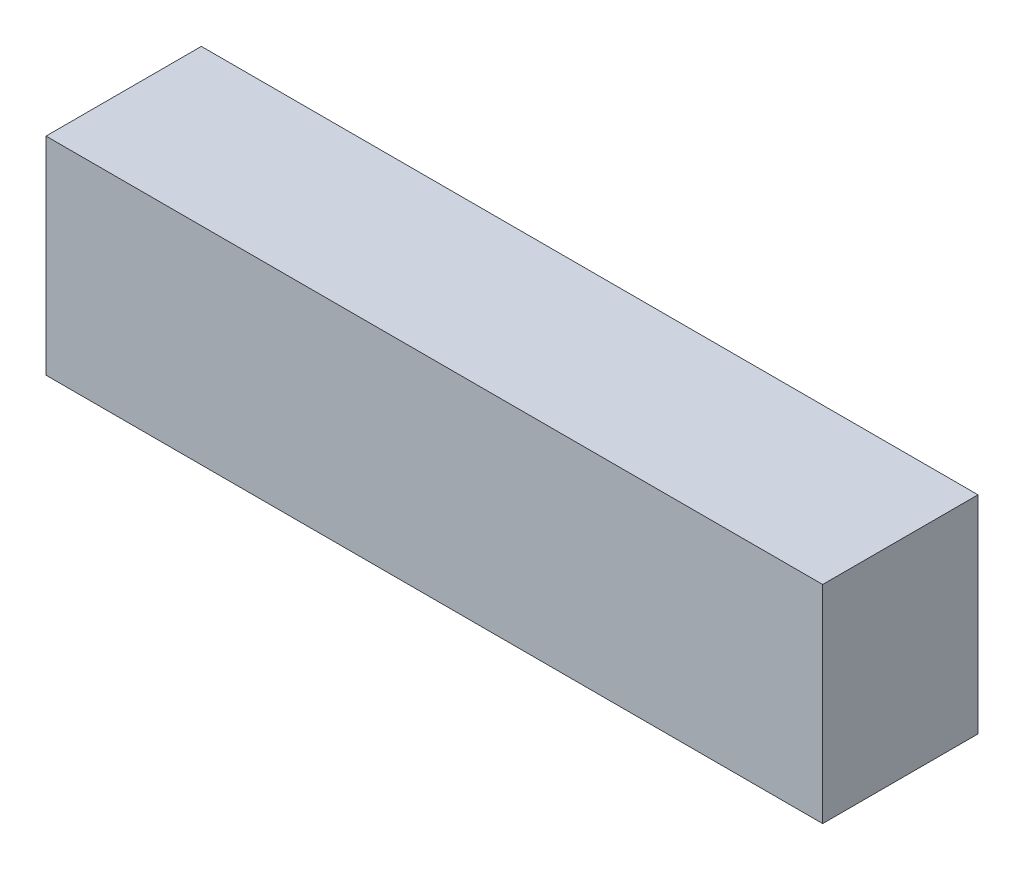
from build123d import *

# Parameters (mm, degrees)
SKETCH1_W           = 190.5
SKETCH1_H           = 50.8
BOSS_EXTRUDE1_DEPTH = 38.1


with BuildPart() as part:
    # Sketch1 → Boss-Extrude1 (new body)
    with BuildSketch(Plane.XY):
        Rectangle(SKETCH1_W, SKETCH1_H)
    extrude(amount=BOSS_EXTRUDE1_DEPTH)


solid = part.part
